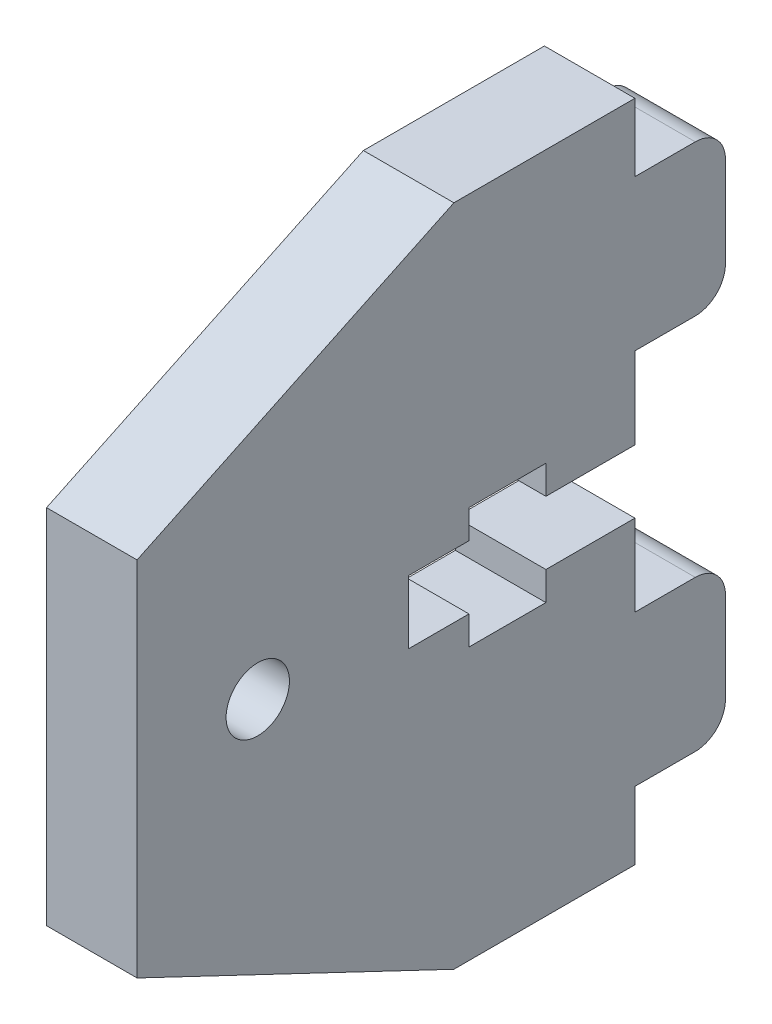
from build123d import *

# Parameters (mm, degrees)
SKETCH_1_R      = 2.1
EXTRUDE_1_DEPTH = 6


with BuildPart() as part:
    # Sketch 1 → Extrude 1 (new body)
    # profile 1 of 3: a face of its own
    with BuildSketch(Plane(origin=(0, 0, 0), x_dir=(0, 0, -1), z_dir=(1, 0, 0))):
        with BuildLine():
            Line((0, 39.5), (0, 29.5))
            Line((0, 29.5), (4, 29.5))
            ThreePointArc((4, 29.5), (5.414213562, 30.085786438), (6, 31.5))
            Line((6, 31.5), (6, 37.5))
            ThreePointArc((6, 37.5), (5.414213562, 38.914213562), (4, 39.5))
            Line((4, 39.5), (0, 39.5))
        make_face()
    # profile 2 of 3: a face of its own
    with BuildSketch(Plane(origin=(0, 0, 0), x_dir=(0, 0, -1), z_dir=(1, 0, 0))):
        with BuildLine():
            Line((0, 14.5), (0, 4.5))
            Line((0, 4.5), (4, 4.5))
            ThreePointArc((4, 4.5), (5.414213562, 5.085786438), (6, 6.5))
            Line((6, 6.5), (6, 12.5))
            ThreePointArc((6, 12.5), (5.414213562, 13.914213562), (4, 14.5))
            Line((4, 14.5), (0, 14.5))
        make_face()
    # profile 3 of 3: a face of its own
    with BuildSketch(Plane(origin=(0, 0, 0), x_dir=(0, 0, -1), z_dir=(1, 0, 0))):
        Polygon((-12, 0), (0, 0), (0, 4.5), (0, 14.5), (0, 19.9), (-5.9, 19.9), (-5.9, 18), (-11, 18), (-11, 19.9), (-15, 19.9), (-15, 24.1), (-11, 24.1), (-11, 26), (-5.9, 26), (-5.9, 24.1), (0, 24.1), (0, 29.5), (0, 39.5), (0, 44), (-12, 44), (-33, 34), (-33, 10), align=None)
        with Locations((-25, 22)):
            Circle(SKETCH_1_R, mode=Mode.SUBTRACT)
    extrude(amount=EXTRUDE_1_DEPTH)


solid = part.part
